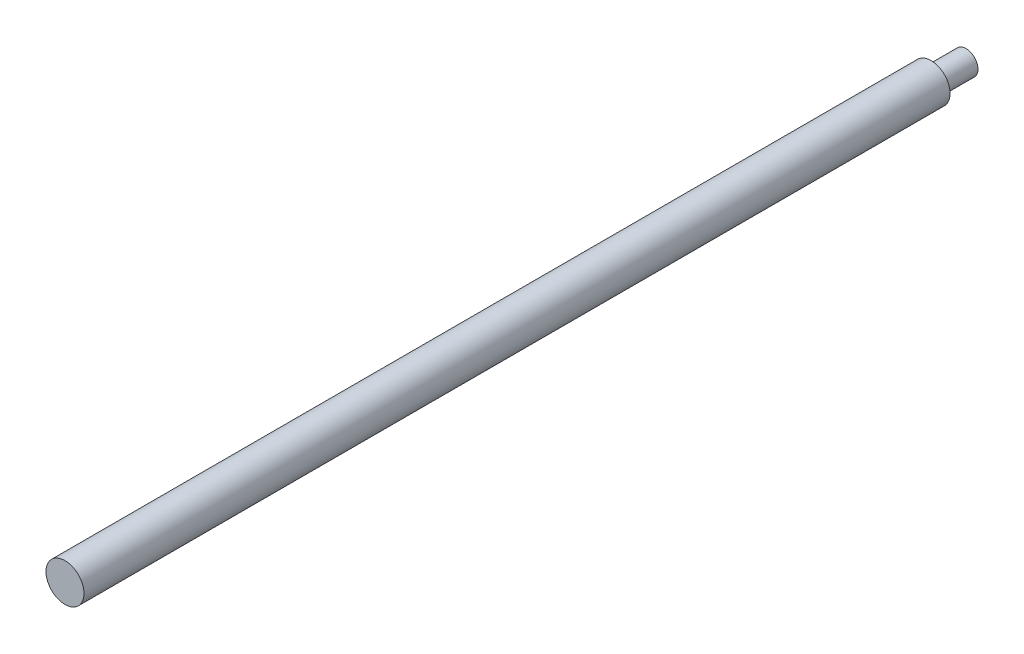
ISO-10303-21;
HEADER;
FILE_DESCRIPTION(('STEP AP214'),'2;1');
FILE_NAME('part.step','',(''),(''),'','','');
FILE_SCHEMA(('AUTOMOTIVE_DESIGN { 1 0 10303 214 1 1 1 1 }'));
ENDSEC;
DATA;
#1=APPLICATION_CONTEXT('core data for automotive mechanical design processes');
#2=APPLICATION_PROTOCOL_DEFINITION('international standard','automotive_design',2000,#1);
#3=PRODUCT_CONTEXT('',#1,'mechanical');
#4=PRODUCT('Part','Part','',(#3));
#5=PRODUCT_RELATED_PRODUCT_CATEGORY('part','',(#4));
#6=PRODUCT_DEFINITION_FORMATION('','',#4);
#7=PRODUCT_DEFINITION_CONTEXT('part definition',#1,'design');
#8=PRODUCT_DEFINITION('design','',#6,#7);
#9=PRODUCT_DEFINITION_SHAPE('','',#8);
#10=(LENGTH_UNIT() NAMED_UNIT(*) SI_UNIT(.MILLI.,.METRE.));
#11=(NAMED_UNIT(*) PLANE_ANGLE_UNIT() SI_UNIT($,.RADIAN.));
#12=(NAMED_UNIT(*) SI_UNIT($,.STERADIAN.) SOLID_ANGLE_UNIT());
#13=UNCERTAINTY_MEASURE_WITH_UNIT(LENGTH_MEASURE(1.E-05),#10,'distance_accuracy_value','');
#14=(GEOMETRIC_REPRESENTATION_CONTEXT(3) GLOBAL_UNCERTAINTY_ASSIGNED_CONTEXT((#13)) GLOBAL_UNIT_ASSIGNED_CONTEXT((#10,
#11,#12)) REPRESENTATION_CONTEXT('',''));
#15=CARTESIAN_POINT('',(0.,0.,0.));
#16=DIRECTION('',(0.,0.,1.));
#17=DIRECTION('',(1.,0.,0.));
#18=AXIS2_PLACEMENT_3D('',#15,#16,#17);
#19=CARTESIAN_POINT('',(0.,0.,-63.627));
#20=DIRECTION('',(0.,0.,1.));
#21=DIRECTION('',(1.,0.,0.));
#22=AXIS2_PLACEMENT_3D('',#19,#20,#21);
#23=CYLINDRICAL_SURFACE('',#22,3.175);
#24=CARTESIAN_POINT('',(0.,0.,-57.785));
#25=DIRECTION('',(0.,0.,1.));
#26=DIRECTION('',(1.,0.,0.));
#27=AXIS2_PLACEMENT_3D('',#24,#25,#26);
#28=CIRCLE('',#27,3.175);
#29=CARTESIAN_POINT('',(3.175,0.,-57.785));
#30=VERTEX_POINT('',#29);
#31=EDGE_CURVE('E37',#30,#30,#28,.T.);
#32=ORIENTED_EDGE('',*,*,#31,.T.);
#33=EDGE_LOOP('',(#32));
#34=FACE_BOUND('',#33,.T.);
#35=CARTESIAN_POINT('',(0.,0.,86.8680000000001));
#36=DIRECTION('',(0.,0.,1.));
#37=DIRECTION('',(1.,0.,0.));
#38=AXIS2_PLACEMENT_3D('',#35,#36,#37);
#39=CIRCLE('',#38,3.175);
#40=CARTESIAN_POINT('',(3.175,0.,86.8680000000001));
#41=VERTEX_POINT('',#40);
#42=EDGE_CURVE('E42',#41,#41,#39,.F.);
#43=ORIENTED_EDGE('',*,*,#42,.T.);
#44=EDGE_LOOP('',(#43));
#45=FACE_BOUND('',#44,.T.);
#46=ADVANCED_FACE('F16',(#34,#45),#23,.T.);
#47=CARTESIAN_POINT('',(0.,0.,-56.007));
#48=DIRECTION('',(0.,0.,-1.));
#49=DIRECTION('',(-1.,0.,0.));
#50=AXIS2_PLACEMENT_3D('',#47,#48,#49);
#51=CONICAL_SURFACE('',#50,1.0795,1.02974425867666);
#52=CARTESIAN_POINT('',(0.,0.,-55.3583709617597));
#53=VERTEX_POINT('',#52);
#54=VERTEX_LOOP('',#53);
#55=FACE_BOUND('',#54,.T.);
#56=CARTESIAN_POINT('',(0.,0.,-56.007));
#57=DIRECTION('',(0.,0.,-1.));
#58=DIRECTION('',(-1.,0.,0.));
#59=AXIS2_PLACEMENT_3D('',#56,#57,#58);
#60=CIRCLE('',#59,1.0795);
#61=CARTESIAN_POINT('',(-1.0795,0.,-56.007));
#62=VERTEX_POINT('',#61);
#63=EDGE_CURVE('E35',#62,#62,#60,.T.);
#64=ORIENTED_EDGE('',*,*,#63,.T.);
#65=EDGE_LOOP('',(#64));
#66=FACE_BOUND('',#65,.T.);
#67=ADVANCED_FACE('F27',(#55,#66),#51,.F.);
#68=CARTESIAN_POINT('',(0.,0.,-62.747118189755));
#69=DIRECTION('',(0.,0.,1.));
#70=DIRECTION('',(1.,0.,0.));
#71=AXIS2_PLACEMENT_3D('',#68,#69,#70);
#72=CYLINDRICAL_SURFACE('',#71,1.0795);
#73=ORIENTED_EDGE('',*,*,#63,.F.);
#74=EDGE_LOOP('',(#73));
#75=FACE_BOUND('',#74,.T.);
#76=CARTESIAN_POINT('',(0.,0.,-62.747118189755));
#77=DIRECTION('',(0.,0.,-1.));
#78=DIRECTION('',(-1.,0.,0.));
#79=AXIS2_PLACEMENT_3D('',#76,#77,#78);
#80=CIRCLE('',#79,1.0795);
#81=CARTESIAN_POINT('',(-1.0795,0.,-62.747118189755));
#82=VERTEX_POINT('',#81);
#83=EDGE_CURVE('E19',#82,#82,#80,.T.);
#84=ORIENTED_EDGE('',*,*,#83,.T.);
#85=EDGE_LOOP('',(#84));
#86=FACE_BOUND('',#85,.T.);
#87=ADVANCED_FACE('F30',(#75,#86),#72,.F.);
#88=CARTESIAN_POINT('',(0.,0.,-63.627));
#89=DIRECTION('',(0.,0.,-1.));
#90=DIRECTION('',(-1.,0.,0.));
#91=AXIS2_PLACEMENT_3D('',#88,#89,#90);
#92=CONICAL_SURFACE('',#91,1.5875,0.523598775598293);
#93=ORIENTED_EDGE('',*,*,#83,.F.);
#94=EDGE_LOOP('',(#93));
#95=FACE_BOUND('',#94,.T.);
#96=CARTESIAN_POINT('',(0.,0.,-63.627));
#97=DIRECTION('',(0.,0.,-1.));
#98=DIRECTION('',(-1.,0.,0.));
#99=AXIS2_PLACEMENT_3D('',#96,#97,#98);
#100=CIRCLE('',#99,1.5875);
#101=CARTESIAN_POINT('',(-1.5875,0.,-63.627));
#102=VERTEX_POINT('',#101);
#103=EDGE_CURVE('E40',#102,#102,#100,.F.);
#104=ORIENTED_EDGE('',*,*,#103,.F.);
#105=EDGE_LOOP('',(#104));
#106=FACE_BOUND('',#105,.T.);
#107=ADVANCED_FACE('F84',(#95,#106),#92,.F.);
#108=CARTESIAN_POINT('',(0.,0.,-63.627));
#109=DIRECTION('',(0.,0.,-1.));
#110=DIRECTION('',(-1.,0.,0.));
#111=AXIS2_PLACEMENT_3D('',#108,#109,#110);
#112=PLANE('',#111);
#113=ORIENTED_EDGE('',*,*,#103,.T.);
#114=EDGE_LOOP('',(#113));
#115=FACE_BOUND('',#114,.T.);
#116=CARTESIAN_POINT('',(0.,0.,-63.627));
#117=DIRECTION('',(0.,0.,1.));
#118=DIRECTION('',(1.,0.,0.));
#119=AXIS2_PLACEMENT_3D('',#116,#117,#118);
#120=CIRCLE('',#119,1.99898);
#121=CARTESIAN_POINT('',(1.99898,0.,-63.627));
#122=VERTEX_POINT('',#121);
#123=EDGE_CURVE('E11',#122,#122,#120,.T.);
#124=ORIENTED_EDGE('',*,*,#123,.F.);
#125=EDGE_LOOP('',(#124));
#126=FACE_BOUND('',#125,.T.);
#127=ADVANCED_FACE('F91',(#115,#126),#112,.T.);
#128=CARTESIAN_POINT('',(0.,0.,-61.5646758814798));
#129=DIRECTION('',(0.,0.,1.));
#130=DIRECTION('',(1.,0.,0.));
#131=AXIS2_PLACEMENT_3D('',#128,#129,#130);
#132=CYLINDRICAL_SURFACE('',#131,1.99898);
#133=CARTESIAN_POINT('',(0.,0.,-57.785));
#134=DIRECTION('',(0.,0.,1.));
#135=DIRECTION('',(1.,0.,0.));
#136=AXIS2_PLACEMENT_3D('',#133,#134,#135);
#137=CIRCLE('',#136,1.99898);
#138=CARTESIAN_POINT('',(1.99898,0.,-57.785));
#139=VERTEX_POINT('',#138);
#140=EDGE_CURVE('E23',#139,#139,#137,.F.);
#141=ORIENTED_EDGE('',*,*,#140,.T.);
#142=EDGE_LOOP('',(#141));
#143=FACE_BOUND('',#142,.T.);
#144=ORIENTED_EDGE('',*,*,#123,.T.);
#145=EDGE_LOOP('',(#144));
#146=FACE_BOUND('',#145,.T.);
#147=ADVANCED_FACE('F63',(#143,#146),#132,.T.);
#148=CARTESIAN_POINT('',(-4.21924893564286,0.,-57.785));
#149=DIRECTION('',(0.,0.,1.));
#150=DIRECTION('',(1.,0.,0.));
#151=AXIS2_PLACEMENT_3D('',#148,#149,#150);
#152=PLANE('',#151);
#153=ORIENTED_EDGE('',*,*,#140,.F.);
#154=EDGE_LOOP('',(#153));
#155=FACE_BOUND('',#154,.T.);
#156=ORIENTED_EDGE('',*,*,#31,.F.);
#157=EDGE_LOOP('',(#156));
#158=FACE_BOUND('',#157,.T.);
#159=ADVANCED_FACE('F57',(#155,#158),#152,.F.);
#160=CARTESIAN_POINT('',(0.,0.,86.8680000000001));
#161=DIRECTION('',(0.,0.,-1.));
#162=DIRECTION('',(-1.,0.,0.));
#163=AXIS2_PLACEMENT_3D('',#160,#161,#162);
#164=PLANE('',#163);
#165=ORIENTED_EDGE('',*,*,#42,.F.);
#166=EDGE_LOOP('',(#165));
#167=FACE_BOUND('',#166,.T.);
#168=ADVANCED_FACE('F32',(#167),#164,.F.);
#169=CLOSED_SHELL('',(#46,#67,#87,#107,#127,#147,#159,#168));
#170=MANIFOLD_SOLID_BREP('B1',#169);
#171=ADVANCED_BREP_SHAPE_REPRESENTATION('',(#18,#170),#14);
#172=SHAPE_DEFINITION_REPRESENTATION(#9,#171);
ENDSEC;
END-ISO-10303-21;
